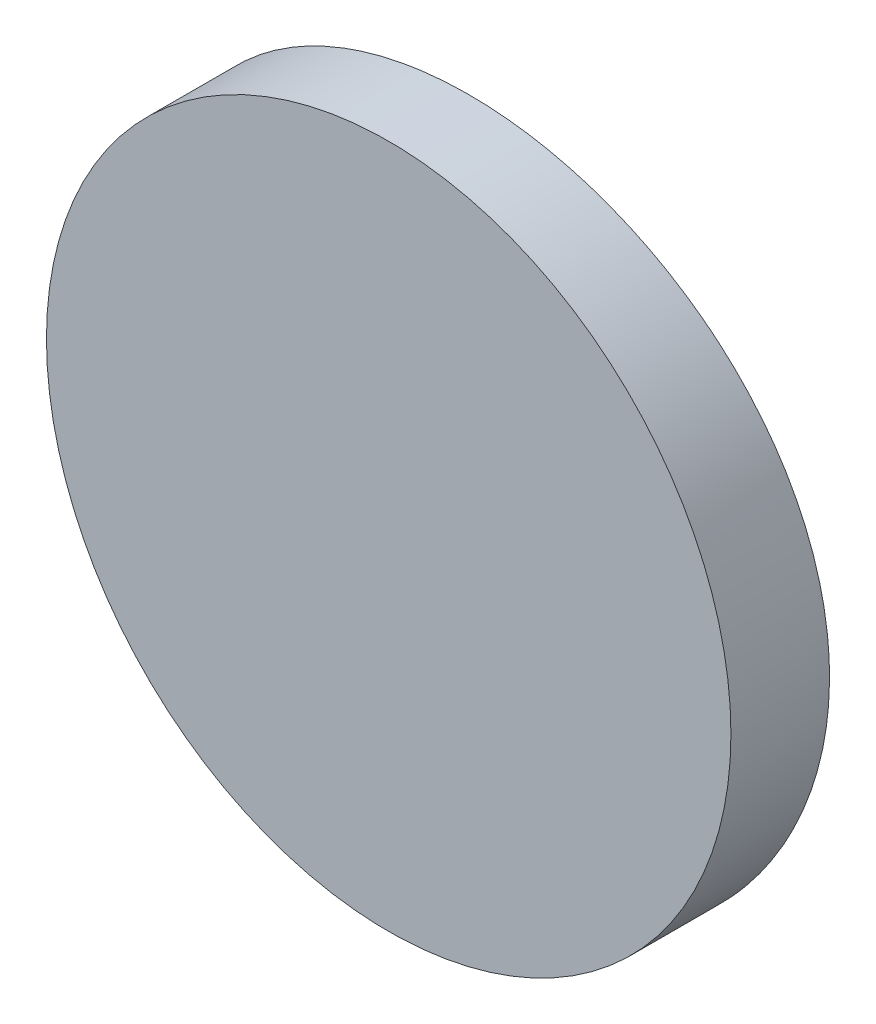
ISO-10303-21;
HEADER;
FILE_DESCRIPTION(('STEP AP214'),'2;1');
FILE_NAME('part.step','',(''),(''),'','','');
FILE_SCHEMA(('AUTOMOTIVE_DESIGN { 1 0 10303 214 1 1 1 1 }'));
ENDSEC;
DATA;
#1=APPLICATION_CONTEXT('core data for automotive mechanical design processes');
#2=APPLICATION_PROTOCOL_DEFINITION('international standard','automotive_design',2000,#1);
#3=PRODUCT_CONTEXT('',#1,'mechanical');
#4=PRODUCT('Part','Part','',(#3));
#5=PRODUCT_RELATED_PRODUCT_CATEGORY('part','',(#4));
#6=PRODUCT_DEFINITION_FORMATION('','',#4);
#7=PRODUCT_DEFINITION_CONTEXT('part definition',#1,'design');
#8=PRODUCT_DEFINITION('design','',#6,#7);
#9=PRODUCT_DEFINITION_SHAPE('','',#8);
#10=(LENGTH_UNIT() NAMED_UNIT(*) SI_UNIT(.MILLI.,.METRE.));
#11=(NAMED_UNIT(*) PLANE_ANGLE_UNIT() SI_UNIT($,.RADIAN.));
#12=(NAMED_UNIT(*) SI_UNIT($,.STERADIAN.) SOLID_ANGLE_UNIT());
#13=UNCERTAINTY_MEASURE_WITH_UNIT(LENGTH_MEASURE(1.E-05),#10,'distance_accuracy_value','');
#14=(GEOMETRIC_REPRESENTATION_CONTEXT(3) GLOBAL_UNCERTAINTY_ASSIGNED_CONTEXT((#13)) GLOBAL_UNIT_ASSIGNED_CONTEXT((#10,
#11,#12)) REPRESENTATION_CONTEXT('',''));
#15=CARTESIAN_POINT('',(0.,0.,0.));
#16=DIRECTION('',(0.,0.,1.));
#17=DIRECTION('',(1.,0.,0.));
#18=AXIS2_PLACEMENT_3D('',#15,#16,#17);
#19=CARTESIAN_POINT('',(0.,0.,2.));
#20=DIRECTION('',(0.,0.,-1.));
#21=DIRECTION('',(-1.,0.,0.));
#22=AXIS2_PLACEMENT_3D('',#19,#20,#21);
#23=CYLINDRICAL_SURFACE('',#22,4.);
#24=CARTESIAN_POINT('',(-4.,0.,0.957311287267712));
#25=CARTESIAN_POINT('',(-3.99999033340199,-0.224002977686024,0.957314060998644));
#26=CARTESIAN_POINT('',(-3.98112010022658,-0.448152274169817,0.959339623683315));
#27=CARTESIAN_POINT('',(-3.90613102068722,-0.890231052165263,0.967221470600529));
#28=CARTESIAN_POINT('',(-3.84997159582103,-1.10815348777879,0.973081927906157));
#29=CARTESIAN_POINT('',(-3.7020623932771,-1.53131287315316,0.987962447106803));
#30=CARTESIAN_POINT('',(-3.61033476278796,-1.73655762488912,0.996980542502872));
#31=CARTESIAN_POINT('',(-3.3939366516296,-2.1286955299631,1.01715782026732));
#32=CARTESIAN_POINT('',(-3.26927251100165,-2.31559220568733,1.0283165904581));
#33=CARTESIAN_POINT('',(-2.98999545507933,-2.66653235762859,1.05156878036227));
#34=CARTESIAN_POINT('',(-2.83527564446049,-2.83049056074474,1.06366544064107));
#35=CARTESIAN_POINT('',(-2.50050809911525,-3.13016475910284,1.08740107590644));
#36=CARTESIAN_POINT('',(-2.32045918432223,-3.26587943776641,1.0990400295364));
#37=CARTESIAN_POINT('',(-1.93961838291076,-3.50551180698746,1.12058117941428));
#38=CARTESIAN_POINT('',(-1.73877847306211,-3.60935358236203,1.13047920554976));
#39=CARTESIAN_POINT('',(-1.32238960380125,-3.78180667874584,1.1473879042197));
#40=CARTESIAN_POINT('',(-1.10684104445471,-3.85041895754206,1.1543986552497));
#41=CARTESIAN_POINT('',(-0.66801804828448,-3.95021408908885,1.16472011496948));
#42=CARTESIAN_POINT('',(-0.44477590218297,-3.98153747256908,1.16804471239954));
#43=CARTESIAN_POINT('',(0.00381981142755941,-4.00630064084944,1.17066655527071));
#44=CARTESIAN_POINT('',(0.229173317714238,-3.99974152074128,1.16996391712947));
#45=CARTESIAN_POINT('',(0.674640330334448,-3.94903962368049,1.16462179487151));
#46=CARTESIAN_POINT('',(0.894771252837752,-3.90504796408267,1.15999814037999));
#47=CARTESIAN_POINT('',(1.32450776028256,-3.78096534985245,1.14735163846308));
#48=CARTESIAN_POINT('',(1.53411319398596,-3.70087387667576,1.13932874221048));
#49=CARTESIAN_POINT('',(1.93732325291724,-3.50670055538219,1.12075836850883));
#50=CARTESIAN_POINT('',(2.13089559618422,-3.39255216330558,1.11020595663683));
#51=CARTESIAN_POINT('',(2.49619243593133,-3.13355359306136,1.08775986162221));
#52=CARTESIAN_POINT('',(2.66791621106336,-2.98870240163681,1.07586613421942));
#53=CARTESIAN_POINT('',(2.98552703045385,-2.67156090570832,1.05200224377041));
#54=CARTESIAN_POINT('',(3.13128278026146,-2.49913908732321,1.04003199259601));
#55=CARTESIAN_POINT('',(3.39180272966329,-2.13220579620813,1.01742243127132));
#56=CARTESIAN_POINT('',(3.50656687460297,-1.93769428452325,1.0067831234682));
#57=CARTESIAN_POINT('',(3.70184704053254,-1.53199861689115,0.988039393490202));
#58=CARTESIAN_POINT('',(3.78235441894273,-1.32081026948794,0.979935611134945));
#59=CARTESIAN_POINT('',(3.90672908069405,-0.887808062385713,0.967193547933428));
#60=CARTESIAN_POINT('',(3.95059762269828,-0.665994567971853,0.962555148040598));
#61=CARTESIAN_POINT('',(4.00027935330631,-0.219192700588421,0.95728992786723));
#62=CARTESIAN_POINT('',(4.00627646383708,0.00577500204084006,0.956643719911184));
#63=CARTESIAN_POINT('',(3.98052861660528,0.453512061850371,0.959384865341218));
#64=CARTESIAN_POINT('',(3.94878423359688,0.676281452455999,0.962772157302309));
#65=CARTESIAN_POINT('',(3.84860860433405,1.11275884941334,0.973180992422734));
#66=CARTESIAN_POINT('',(3.78026478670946,1.32648714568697,0.980193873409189));
#67=CARTESIAN_POINT('',(3.6089197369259,1.73944698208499,0.997056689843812));
#68=CARTESIAN_POINT('',(3.50591761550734,1.93867815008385,1.0069066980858));
#69=CARTESIAN_POINT('',(3.26772096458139,2.31782524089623,1.02838075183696));
#70=CARTESIAN_POINT('',(3.13240483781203,2.49766438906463,1.04001143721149));
#71=CARTESIAN_POINT('',(2.83359505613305,2.83214285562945,1.06371483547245));
#72=CARTESIAN_POINT('',(2.67010061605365,2.98678147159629,1.07578756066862));
#73=CARTESIAN_POINT('',(2.31877607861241,3.26710613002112,1.09907351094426));
#74=CARTESIAN_POINT('',(2.13084981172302,3.39267199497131,1.11028304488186));
#75=CARTESIAN_POINT('',(1.73646953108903,3.61045881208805,1.13052555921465));
#76=CARTESIAN_POINT('',(1.53001579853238,3.70268027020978,1.13955857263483));
#77=CARTESIAN_POINT('',(1.10485606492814,3.85095795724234,1.1544136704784));
#78=CARTESIAN_POINT('',(0.88617536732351,3.9070860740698,1.16024213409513));
#79=CARTESIAN_POINT('',(0.442428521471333,3.98181826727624,1.16805767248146));
#80=CARTESIAN_POINT('',(0.217362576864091,4.00042353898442,1.17004486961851));
#81=CARTESIAN_POINT('',(-0.231587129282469,3.99956388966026,1.16995379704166));
#82=CARTESIAN_POINT('',(-0.455471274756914,3.9802852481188,1.16789541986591));
#83=CARTESIAN_POINT('',(-0.896800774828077,3.90459650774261,1.15998377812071));
#84=CARTESIAN_POINT('',(-1.11424612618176,3.8481863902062,1.15413051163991));
#85=CARTESIAN_POINT('',(-1.53651891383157,3.69988917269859,1.13928461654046));
#86=CARTESIAN_POINT('',(-1.74134856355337,3.60800831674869,1.13029254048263));
#87=CARTESIAN_POINT('',(-2.13270870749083,3.39139739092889,1.11016989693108));
#88=CARTESIAN_POINT('',(-2.31923923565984,3.26666738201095,1.09903933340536));
#89=CARTESIAN_POINT('',(-2.66966050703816,2.9872018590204,1.07582021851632));
#90=CARTESIAN_POINT('',(-2.83344028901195,2.83232756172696,1.06372739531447));
#91=CARTESIAN_POINT('',(-3.13276632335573,2.49724828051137,1.0399824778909));
#92=CARTESIAN_POINT('',(-3.26830581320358,2.31703724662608,1.02833048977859));
#93=CARTESIAN_POINT('',(-3.50761322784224,1.9358349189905,1.00675133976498));
#94=CARTESIAN_POINT('',(-3.6112902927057,1.7347863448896,0.996829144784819));
#95=CARTESIAN_POINT('',(-3.78327265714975,1.31815305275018,0.979891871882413));
#96=CARTESIAN_POINT('',(-3.851617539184,1.10258490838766,0.972873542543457));
#97=CARTESIAN_POINT('',(-3.93410199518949,0.7381819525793,0.964294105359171));
#98=CARTESIAN_POINT('',(-3.95877959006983,0.591670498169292,0.961688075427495));
#99=CARTESIAN_POINT('',(-3.99173175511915,0.296794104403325,0.95819575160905));
#100=CARTESIAN_POINT('',(-4.00000640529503,0.148429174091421,0.957309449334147));
#101=CARTESIAN_POINT('',(-4.,0.,0.957311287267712));
#102=B_SPLINE_CURVE_WITH_KNOTS('',3,(#24,#25,#26,#27,#28,#29,#30,#31,#32,#33,#34,#35,#36,#37,
#38,#39,#40,#41,#42,#43,#44,#45,#46,#47,#48,#49,#50,#51,#52,#53,#54,#55,#56,#57,#58,#59,#60,#61,
#62,#63,#64,#65,#66,#67,#68,#69,#70,#71,#72,#73,#74,#75,#76,#77,#78,#79,#80,#81,#82,#83,#84,#85,
#86,#87,#88,#89,#90,#91,#92,#93,#94,#95,#96,#97,#98,#99,#100,#101),.UNSPECIFIED.,.T.,.F.,(4,2,2,
2,2,2,2,2,2,2,2,2,2,2,2,2,2,2,2,2,2,2,2,2,2,2,2,2,2,2,2,2,2,2,2,2,2,2,4),(0.,0.671466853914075,
1.34366560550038,2.01544647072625,2.68709811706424,3.36118378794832,4.03530087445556,
4.71101133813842,5.38670343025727,6.05984089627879,6.73295890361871,7.40337231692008,
8.07379536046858,8.74553702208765,9.41730085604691,10.0923702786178,10.7674408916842,
11.4426817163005,12.1178993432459,12.7898352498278,13.4617609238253,14.132088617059,
14.8024335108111,15.4753417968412,16.1482688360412,16.8239297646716,17.4995804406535,
18.1738812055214,18.8481604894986,19.5191325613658,20.190104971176,20.8609593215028,
21.5318124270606,22.2058304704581,22.8800097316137,23.5560940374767,24.2314192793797,
24.6763497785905,25.1212781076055),.UNSPECIFIED.);
#103=CARTESIAN_POINT('',(-4.,0.,0.957311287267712));
#104=VERTEX_POINT('',#103);
#105=EDGE_CURVE('E10',#104,#104,#102,.T.);
#106=ORIENTED_EDGE('',*,*,#105,.T.);
#107=EDGE_LOOP('',(#106));
#108=FACE_BOUND('',#107,.T.);
#109=CARTESIAN_POINT('',(0.,0.,2.11));
#110=DIRECTION('',(0.,0.,1.));
#111=DIRECTION('',(1.,0.,0.));
#112=AXIS2_PLACEMENT_3D('',#109,#110,#111);
#113=CIRCLE('',#112,4.);
#114=CARTESIAN_POINT('',(4.,0.,2.11));
#115=VERTEX_POINT('',#114);
#116=EDGE_CURVE('E53',#115,#115,#113,.T.);
#117=ORIENTED_EDGE('',*,*,#116,.F.);
#118=EDGE_LOOP('',(#117));
#119=FACE_BOUND('',#118,.T.);
#120=ADVANCED_FACE('F43',(#108,#119),#23,.T.);
#121=CARTESIAN_POINT('',(0.,4.29034055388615,-36.55));
#122=DIRECTION('',(0.,1.,0.));
#123=DIRECTION('',(0.,0.,1.));
#124=AXIS2_PLACEMENT_3D('',#121,#122,#123);
#125=CYLINDRICAL_SURFACE('',#124,37.72);
#126=ORIENTED_EDGE('',*,*,#105,.F.);
#127=EDGE_LOOP('',(#126));
#128=FACE_BOUND('',#127,.T.);
#129=ADVANCED_FACE('F61',(#128),#125,.F.);
#130=CARTESIAN_POINT('',(0.,0.,2.11));
#131=DIRECTION('',(0.,0.,1.));
#132=DIRECTION('',(1.,0.,0.));
#133=AXIS2_PLACEMENT_3D('',#130,#131,#132);
#134=PLANE('',#133);
#135=ORIENTED_EDGE('',*,*,#116,.T.);
#136=EDGE_LOOP('',(#135));
#137=FACE_BOUND('',#136,.T.);
#138=ADVANCED_FACE('F62',(#137),#134,.T.);
#139=CLOSED_SHELL('',(#120,#129,#138));
#140=MANIFOLD_SOLID_BREP('B2',#139);
#141=ADVANCED_BREP_SHAPE_REPRESENTATION('',(#18,#140),#14);
#142=SHAPE_DEFINITION_REPRESENTATION(#9,#141);
ENDSEC;
END-ISO-10303-21;
